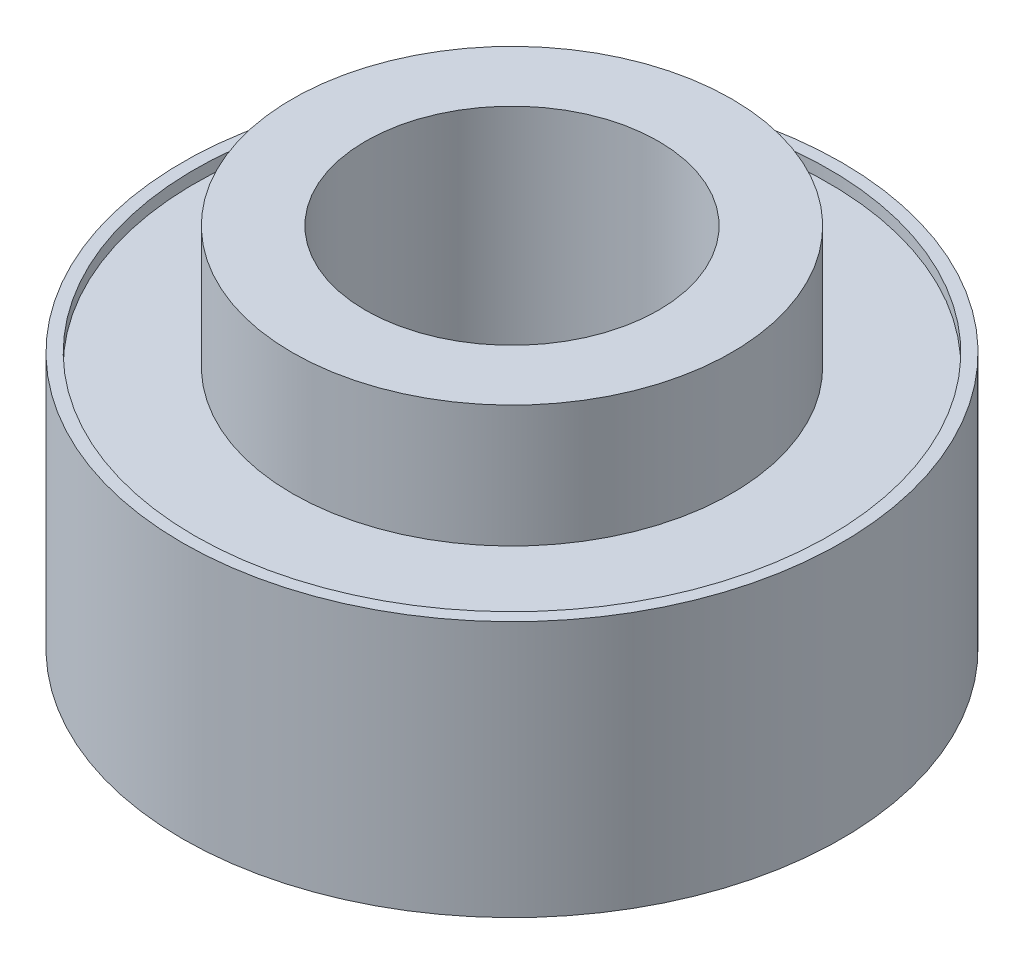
ISO-10303-21;
HEADER;
FILE_DESCRIPTION(('STEP AP214'),'2;1');
FILE_NAME('part.step','',(''),(''),'','','');
FILE_SCHEMA(('AUTOMOTIVE_DESIGN { 1 0 10303 214 1 1 1 1 }'));
ENDSEC;
DATA;
#1=APPLICATION_CONTEXT('core data for automotive mechanical design processes');
#2=APPLICATION_PROTOCOL_DEFINITION('international standard','automotive_design',2000,#1);
#3=PRODUCT_CONTEXT('',#1,'mechanical');
#4=PRODUCT('Part','Part','',(#3));
#5=PRODUCT_RELATED_PRODUCT_CATEGORY('part','',(#4));
#6=PRODUCT_DEFINITION_FORMATION('','',#4);
#7=PRODUCT_DEFINITION_CONTEXT('part definition',#1,'design');
#8=PRODUCT_DEFINITION('design','',#6,#7);
#9=PRODUCT_DEFINITION_SHAPE('','',#8);
#10=(LENGTH_UNIT() NAMED_UNIT(*) SI_UNIT(.MILLI.,.METRE.));
#11=(NAMED_UNIT(*) PLANE_ANGLE_UNIT() SI_UNIT($,.RADIAN.));
#12=(NAMED_UNIT(*) SI_UNIT($,.STERADIAN.) SOLID_ANGLE_UNIT());
#13=UNCERTAINTY_MEASURE_WITH_UNIT(LENGTH_MEASURE(1.E-05),#10,'distance_accuracy_value','');
#14=(GEOMETRIC_REPRESENTATION_CONTEXT(3) GLOBAL_UNCERTAINTY_ASSIGNED_CONTEXT((#13)) GLOBAL_UNIT_ASSIGNED_CONTEXT((#10,
#11,#12)) REPRESENTATION_CONTEXT('',''));
#15=CARTESIAN_POINT('',(0.,0.,0.));
#16=DIRECTION('',(0.,0.,1.));
#17=DIRECTION('',(1.,0.,0.));
#18=AXIS2_PLACEMENT_3D('',#15,#16,#17);
#19=CARTESIAN_POINT('',(0.,0.5,0.));
#20=DIRECTION('',(0.,-1.,0.));
#21=DIRECTION('',(0.,0.,-1.));
#22=AXIS2_PLACEMENT_3D('',#19,#20,#21);
#23=PLANE('',#22);
#24=CARTESIAN_POINT('',(0.,0.5,0.));
#25=DIRECTION('',(0.,-1.,0.));
#26=DIRECTION('',(0.,0.,-1.));
#27=AXIS2_PLACEMENT_3D('',#24,#25,#26);
#28=CIRCLE('',#27,13.);
#29=CARTESIAN_POINT('',(0.,0.5,-13.));
#30=VERTEX_POINT('',#29);
#31=EDGE_CURVE('E62',#30,#30,#28,.T.);
#32=ORIENTED_EDGE('',*,*,#31,.T.);
#33=EDGE_LOOP('',(#32));
#34=FACE_BOUND('',#33,.T.);
#35=CARTESIAN_POINT('',(0.,0.5,0.));
#36=DIRECTION('',(0.,-1.,0.));
#37=DIRECTION('',(0.,0.,-1.));
#38=AXIS2_PLACEMENT_3D('',#35,#36,#37);
#39=CIRCLE('',#38,9.);
#40=CARTESIAN_POINT('',(0.,0.5,-9.));
#41=VERTEX_POINT('',#40);
#42=EDGE_CURVE('E86',#41,#41,#39,.T.);
#43=ORIENTED_EDGE('',*,*,#42,.F.);
#44=EDGE_LOOP('',(#43));
#45=FACE_BOUND('',#44,.T.);
#46=ADVANCED_FACE('F43',(#34,#45),#23,.T.);
#47=CARTESIAN_POINT('',(0.,10.,0.));
#48=DIRECTION('',(0.,1.,0.));
#49=DIRECTION('',(0.,0.,1.));
#50=AXIS2_PLACEMENT_3D('',#47,#48,#49);
#51=PLANE('',#50);
#52=CARTESIAN_POINT('',(0.,10.,0.));
#53=DIRECTION('',(0.,1.,0.));
#54=DIRECTION('',(0.,0.,1.));
#55=AXIS2_PLACEMENT_3D('',#52,#53,#54);
#56=CIRCLE('',#55,13.);
#57=CARTESIAN_POINT('',(0.,10.,13.));
#58=VERTEX_POINT('',#57);
#59=EDGE_CURVE('E56',#58,#58,#56,.T.);
#60=ORIENTED_EDGE('',*,*,#59,.T.);
#61=EDGE_LOOP('',(#60));
#62=FACE_BOUND('',#61,.T.);
#63=CARTESIAN_POINT('',(0.,10.,0.));
#64=DIRECTION('',(0.,1.,0.));
#65=DIRECTION('',(0.,0.,1.));
#66=AXIS2_PLACEMENT_3D('',#63,#64,#65);
#67=CIRCLE('',#66,9.);
#68=CARTESIAN_POINT('',(0.,10.,9.));
#69=VERTEX_POINT('',#68);
#70=EDGE_CURVE('E74',#69,#69,#67,.T.);
#71=ORIENTED_EDGE('',*,*,#70,.F.);
#72=EDGE_LOOP('',(#71));
#73=FACE_BOUND('',#72,.T.);
#74=ADVANCED_FACE('F116',(#62,#73),#51,.T.);
#75=CARTESIAN_POINT('',(0.,10.5,0.));
#76=DIRECTION('',(0.,-1.,0.));
#77=DIRECTION('',(0.,0.,-1.));
#78=AXIS2_PLACEMENT_3D('',#75,#76,#77);
#79=CYLINDRICAL_SURFACE('',#78,13.5);
#80=CARTESIAN_POINT('',(0.,10.5,0.));
#81=DIRECTION('',(0.,1.,0.));
#82=DIRECTION('',(0.,0.,1.));
#83=AXIS2_PLACEMENT_3D('',#80,#81,#82);
#84=CIRCLE('',#83,13.5);
#85=CARTESIAN_POINT('',(0.,10.5,-13.5));
#86=VERTEX_POINT('',#85);
#87=EDGE_CURVE('E10',#86,#86,#84,.T.);
#88=CARTESIAN_POINT('',(0.,0.,0.));
#89=DIRECTION('',(0.,1.,0.));
#90=DIRECTION('',(0.,0.,1.));
#91=AXIS2_PLACEMENT_3D('',#88,#89,#90);
#92=CIRCLE('',#91,13.5);
#93=CARTESIAN_POINT('',(0.,0.,-13.5));
#94=VERTEX_POINT('',#93);
#95=EDGE_CURVE('E47',#94,#94,#92,.T.);
#96=CARTESIAN_POINT('',(0.,10.5,-13.5));
#97=CARTESIAN_POINT('',(0.,10.390625,-13.5));
#98=CARTESIAN_POINT('',(0.,10.28125,-13.5));
#99=CARTESIAN_POINT('',(0.,10.0625,-13.5));
#100=CARTESIAN_POINT('',(0.,9.953125,-13.5));
#101=CARTESIAN_POINT('',(0.,9.734375,-13.5));
#102=CARTESIAN_POINT('',(0.,9.625,-13.5));
#103=CARTESIAN_POINT('',(0.,9.40625,-13.5));
#104=CARTESIAN_POINT('',(0.,9.296875,-13.5));
#105=CARTESIAN_POINT('',(0.,9.078125,-13.5));
#106=CARTESIAN_POINT('',(0.,8.96875,-13.5));
#107=CARTESIAN_POINT('',(0.,8.75,-13.5));
#108=CARTESIAN_POINT('',(0.,8.640625,-13.5));
#109=CARTESIAN_POINT('',(0.,8.421875,-13.5));
#110=CARTESIAN_POINT('',(0.,8.3125,-13.5));
#111=CARTESIAN_POINT('',(0.,8.09375,-13.5));
#112=CARTESIAN_POINT('',(0.,7.984375,-13.5));
#113=CARTESIAN_POINT('',(0.,7.765625,-13.5));
#114=CARTESIAN_POINT('',(0.,7.65625,-13.5));
#115=CARTESIAN_POINT('',(0.,7.4375,-13.5));
#116=CARTESIAN_POINT('',(0.,7.328125,-13.5));
#117=CARTESIAN_POINT('',(0.,7.109375,-13.5));
#118=CARTESIAN_POINT('',(0.,7.,-13.5));
#119=CARTESIAN_POINT('',(0.,6.78125,-13.5));
#120=CARTESIAN_POINT('',(0.,6.671875,-13.5));
#121=CARTESIAN_POINT('',(0.,6.453125,-13.5));
#122=CARTESIAN_POINT('',(0.,6.34375,-13.5));
#123=CARTESIAN_POINT('',(0.,6.125,-13.5));
#124=CARTESIAN_POINT('',(0.,6.015625,-13.5));
#125=CARTESIAN_POINT('',(0.,5.796875,-13.5));
#126=CARTESIAN_POINT('',(0.,5.6875,-13.5));
#127=CARTESIAN_POINT('',(0.,5.46875,-13.5));
#128=CARTESIAN_POINT('',(0.,5.359375,-13.5));
#129=CARTESIAN_POINT('',(0.,5.140625,-13.5));
#130=CARTESIAN_POINT('',(0.,5.03125,-13.5));
#131=CARTESIAN_POINT('',(0.,4.8125,-13.5));
#132=CARTESIAN_POINT('',(0.,4.703125,-13.5));
#133=CARTESIAN_POINT('',(0.,4.484375,-13.5));
#134=CARTESIAN_POINT('',(0.,4.375,-13.5));
#135=CARTESIAN_POINT('',(0.,4.15625,-13.5));
#136=CARTESIAN_POINT('',(0.,4.046875,-13.5));
#137=CARTESIAN_POINT('',(0.,3.828125,-13.5));
#138=CARTESIAN_POINT('',(0.,3.71875,-13.5));
#139=CARTESIAN_POINT('',(0.,3.5,-13.5));
#140=CARTESIAN_POINT('',(0.,3.390625,-13.5));
#141=CARTESIAN_POINT('',(0.,3.171875,-13.5));
#142=CARTESIAN_POINT('',(0.,3.0625,-13.5));
#143=CARTESIAN_POINT('',(0.,2.84375,-13.5));
#144=CARTESIAN_POINT('',(0.,2.734375,-13.5));
#145=CARTESIAN_POINT('',(0.,2.515625,-13.5));
#146=CARTESIAN_POINT('',(0.,2.40625,-13.5));
#147=CARTESIAN_POINT('',(0.,2.1875,-13.5));
#148=CARTESIAN_POINT('',(0.,2.078125,-13.5));
#149=CARTESIAN_POINT('',(0.,1.859375,-13.5));
#150=CARTESIAN_POINT('',(0.,1.75,-13.5));
#151=CARTESIAN_POINT('',(0.,1.53125,-13.5));
#152=CARTESIAN_POINT('',(0.,1.421875,-13.5));
#153=CARTESIAN_POINT('',(0.,1.203125,-13.5));
#154=CARTESIAN_POINT('',(0.,1.09375,-13.5));
#155=CARTESIAN_POINT('',(0.,0.875000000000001,-13.5));
#156=CARTESIAN_POINT('',(0.,0.765625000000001,-13.5));
#157=CARTESIAN_POINT('',(0.,0.546875,-13.5));
#158=CARTESIAN_POINT('',(0.,0.4375,-13.5));
#159=CARTESIAN_POINT('',(0.,0.21875,-13.5));
#160=CARTESIAN_POINT('',(0.,0.109375,-13.5));
#161=CARTESIAN_POINT('',(0.,0.,-13.5));
#162=B_SPLINE_CURVE_WITH_KNOTS('',3,(#96,#97,#98,#99,#100,#101,#102,#103,#104,#105,#106,#107,
#108,#109,#110,#111,#112,#113,#114,#115,#116,#117,#118,#119,#120,#121,#122,#123,#124,#125,#126,
#127,#128,#129,#130,#131,#132,#133,#134,#135,#136,#137,#138,#139,#140,#141,#142,#143,#144,#145,
#146,#147,#148,#149,#150,#151,#152,#153,#154,#155,#156,#157,#158,#159,#160,#161),.UNSPECIFIED.,
.F.,.F.,(4,2,2,2,2,2,2,2,2,2,2,2,2,2,2,2,2,2,2,2,2,2,2,2,2,2,2,2,2,2,2,2,4),(0.,0.328125,
0.656250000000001,0.984375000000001,1.3125,1.640625,1.96875,2.296875,2.625,2.953125,3.28125,
3.609375,3.9375,4.265625,4.59375,4.921875,5.25,5.578125,5.90625,6.234375,6.5625,6.890625,
7.21875,7.546875,7.875,8.203125,8.53125,8.859375,9.1875,9.515625,9.84375,10.171875,10.5),.UNSPECIFIED.);
#163=EDGE_CURVE('BSEAM45',#86,#94,#162,.T.);
#164=ORIENTED_EDGE('',*,*,#87,.F.);
#165=ORIENTED_EDGE('',*,*,#95,.T.);
#166=ORIENTED_EDGE('',*,*,#163,.T.);
#167=ORIENTED_EDGE('',*,*,#163,.F.);
#168=EDGE_LOOP('',(#164,#166,#165,#167));
#169=FACE_BOUND('',#168,.T.);
#170=ADVANCED_FACE('F45',(#169),#79,.T.);
#171=CARTESIAN_POINT('',(0.,10.5,0.));
#172=DIRECTION('',(0.,1.,0.));
#173=DIRECTION('',(0.,0.,1.));
#174=AXIS2_PLACEMENT_3D('',#171,#172,#173);
#175=PLANE('',#174);
#176=CARTESIAN_POINT('',(0.,10.5,0.));
#177=DIRECTION('',(0.,1.,0.));
#178=DIRECTION('',(0.,0.,1.));
#179=AXIS2_PLACEMENT_3D('',#176,#177,#178);
#180=CIRCLE('',#179,13.);
#181=CARTESIAN_POINT('',(0.,10.5,13.));
#182=VERTEX_POINT('',#181);
#183=EDGE_CURVE('E58',#182,#182,#180,.T.);
#184=ORIENTED_EDGE('',*,*,#183,.F.);
#185=EDGE_LOOP('',(#184));
#186=FACE_BOUND('',#185,.T.);
#187=ORIENTED_EDGE('',*,*,#87,.T.);
#188=EDGE_LOOP('',(#187));
#189=FACE_BOUND('',#188,.T.);
#190=ADVANCED_FACE('F136',(#186,#189),#175,.T.);
#191=CARTESIAN_POINT('',(0.,0.,0.));
#192=DIRECTION('',(0.,1.,0.));
#193=DIRECTION('',(0.,0.,1.));
#194=AXIS2_PLACEMENT_3D('',#191,#192,#193);
#195=PLANE('',#194);
#196=CARTESIAN_POINT('',(0.,0.,0.));
#197=DIRECTION('',(0.,-1.,0.));
#198=DIRECTION('',(0.,0.,-1.));
#199=AXIS2_PLACEMENT_3D('',#196,#197,#198);
#200=CIRCLE('',#199,13.);
#201=CARTESIAN_POINT('',(0.,0.,-13.));
#202=VERTEX_POINT('',#201);
#203=EDGE_CURVE('E66',#202,#202,#200,.T.);
#204=ORIENTED_EDGE('',*,*,#203,.F.);
#205=EDGE_LOOP('',(#204));
#206=FACE_BOUND('',#205,.T.);
#207=ORIENTED_EDGE('',*,*,#95,.F.);
#208=EDGE_LOOP('',(#207));
#209=FACE_BOUND('',#208,.T.);
#210=ADVANCED_FACE('F134',(#206,#209),#195,.F.);
#211=CARTESIAN_POINT('',(0.,10.,0.));
#212=DIRECTION('',(0.,1.,0.));
#213=DIRECTION('',(0.,0.,1.));
#214=AXIS2_PLACEMENT_3D('',#211,#212,#213);
#215=CYLINDRICAL_SURFACE('',#214,13.);
#216=ORIENTED_EDGE('',*,*,#59,.F.);
#217=EDGE_LOOP('',(#216));
#218=FACE_BOUND('',#217,.T.);
#219=ORIENTED_EDGE('',*,*,#183,.T.);
#220=EDGE_LOOP('',(#219));
#221=FACE_BOUND('',#220,.T.);
#222=ADVANCED_FACE('F129',(#218,#221),#215,.F.);
#223=CARTESIAN_POINT('',(0.,0.5,0.));
#224=DIRECTION('',(0.,-1.,0.));
#225=DIRECTION('',(0.,0.,-1.));
#226=AXIS2_PLACEMENT_3D('',#223,#224,#225);
#227=CYLINDRICAL_SURFACE('',#226,13.);
#228=ORIENTED_EDGE('',*,*,#31,.F.);
#229=EDGE_LOOP('',(#228));
#230=FACE_BOUND('',#229,.T.);
#231=ORIENTED_EDGE('',*,*,#203,.T.);
#232=EDGE_LOOP('',(#231));
#233=FACE_BOUND('',#232,.T.);
#234=ADVANCED_FACE('F127',(#230,#233),#227,.F.);
#235=CARTESIAN_POINT('',(0.,0.,0.));
#236=DIRECTION('',(0.,1.,0.));
#237=DIRECTION('',(0.,0.,1.));
#238=AXIS2_PLACEMENT_3D('',#235,#236,#237);
#239=CYLINDRICAL_SURFACE('',#238,6.);
#240=CARTESIAN_POINT('',(0.,15.,0.));
#241=DIRECTION('',(0.,1.,0.));
#242=DIRECTION('',(0.,0.,1.));
#243=AXIS2_PLACEMENT_3D('',#240,#241,#242);
#244=CIRCLE('',#243,6.);
#245=CARTESIAN_POINT('',(0.,15.,6.));
#246=VERTEX_POINT('',#245);
#247=EDGE_CURVE('E78',#246,#246,#244,.T.);
#248=ORIENTED_EDGE('',*,*,#247,.T.);
#249=EDGE_LOOP('',(#248));
#250=FACE_BOUND('',#249,.T.);
#251=CARTESIAN_POINT('',(0.,-1.,0.));
#252=DIRECTION('',(0.,-1.,0.));
#253=DIRECTION('',(0.,0.,-1.));
#254=AXIS2_PLACEMENT_3D('',#251,#252,#253);
#255=CIRCLE('',#254,6.);
#256=CARTESIAN_POINT('',(0.,-1.,-6.));
#257=VERTEX_POINT('',#256);
#258=EDGE_CURVE('E90',#257,#257,#255,.T.);
#259=ORIENTED_EDGE('',*,*,#258,.T.);
#260=EDGE_LOOP('',(#259));
#261=FACE_BOUND('',#260,.T.);
#262=ADVANCED_FACE('F98',(#250,#261),#239,.F.);
#263=CARTESIAN_POINT('',(0.,15.,0.));
#264=DIRECTION('',(0.,1.,0.));
#265=DIRECTION('',(0.,0.,1.));
#266=AXIS2_PLACEMENT_3D('',#263,#264,#265);
#267=PLANE('',#266);
#268=CARTESIAN_POINT('',(0.,15.,0.));
#269=DIRECTION('',(0.,1.,0.));
#270=DIRECTION('',(0.,0.,1.));
#271=AXIS2_PLACEMENT_3D('',#268,#269,#270);
#272=CIRCLE('',#271,9.);
#273=CARTESIAN_POINT('',(0.,15.,9.));
#274=VERTEX_POINT('',#273);
#275=EDGE_CURVE('E70',#274,#274,#272,.T.);
#276=ORIENTED_EDGE('',*,*,#275,.T.);
#277=EDGE_LOOP('',(#276));
#278=FACE_BOUND('',#277,.T.);
#279=ORIENTED_EDGE('',*,*,#247,.F.);
#280=EDGE_LOOP('',(#279));
#281=FACE_BOUND('',#280,.T.);
#282=ADVANCED_FACE('F112',(#278,#281),#267,.T.);
#283=CARTESIAN_POINT('',(0.,15.,0.));
#284=DIRECTION('',(0.,-1.,0.));
#285=DIRECTION('',(0.,0.,-1.));
#286=AXIS2_PLACEMENT_3D('',#283,#284,#285);
#287=CYLINDRICAL_SURFACE('',#286,9.);
#288=ORIENTED_EDGE('',*,*,#275,.F.);
#289=EDGE_LOOP('',(#288));
#290=FACE_BOUND('',#289,.T.);
#291=ORIENTED_EDGE('',*,*,#70,.T.);
#292=EDGE_LOOP('',(#291));
#293=FACE_BOUND('',#292,.T.);
#294=ADVANCED_FACE('F103',(#290,#293),#287,.T.);
#295=CARTESIAN_POINT('',(0.,-1.,0.));
#296=DIRECTION('',(0.,-1.,0.));
#297=DIRECTION('',(0.,0.,-1.));
#298=AXIS2_PLACEMENT_3D('',#295,#296,#297);
#299=PLANE('',#298);
#300=CARTESIAN_POINT('',(0.,-1.,0.));
#301=DIRECTION('',(0.,-1.,0.));
#302=DIRECTION('',(0.,0.,-1.));
#303=AXIS2_PLACEMENT_3D('',#300,#301,#302);
#304=CIRCLE('',#303,9.);
#305=CARTESIAN_POINT('',(0.,-1.,-9.));
#306=VERTEX_POINT('',#305);
#307=EDGE_CURVE('E85',#306,#306,#304,.T.);
#308=ORIENTED_EDGE('',*,*,#307,.T.);
#309=EDGE_LOOP('',(#308));
#310=FACE_BOUND('',#309,.T.);
#311=ORIENTED_EDGE('',*,*,#258,.F.);
#312=EDGE_LOOP('',(#311));
#313=FACE_BOUND('',#312,.T.);
#314=ADVANCED_FACE('F100',(#310,#313),#299,.T.);
#315=CARTESIAN_POINT('',(0.,-1.,0.));
#316=DIRECTION('',(0.,1.,0.));
#317=DIRECTION('',(0.,0.,1.));
#318=AXIS2_PLACEMENT_3D('',#315,#316,#317);
#319=CYLINDRICAL_SURFACE('',#318,9.);
#320=ORIENTED_EDGE('',*,*,#307,.F.);
#321=EDGE_LOOP('',(#320));
#322=FACE_BOUND('',#321,.T.);
#323=ORIENTED_EDGE('',*,*,#42,.T.);
#324=EDGE_LOOP('',(#323));
#325=FACE_BOUND('',#324,.T.);
#326=ADVANCED_FACE('F102',(#322,#325),#319,.T.);
#327=CLOSED_SHELL('',(#46,#74,#170,#190,#210,#222,#234,#262,#282,#294,#314,#326));
#328=MANIFOLD_SOLID_BREP('B2',#327);
#329=ADVANCED_BREP_SHAPE_REPRESENTATION('',(#18,#328),#14);
#330=SHAPE_DEFINITION_REPRESENTATION(#9,#329);
ENDSEC;
END-ISO-10303-21;
